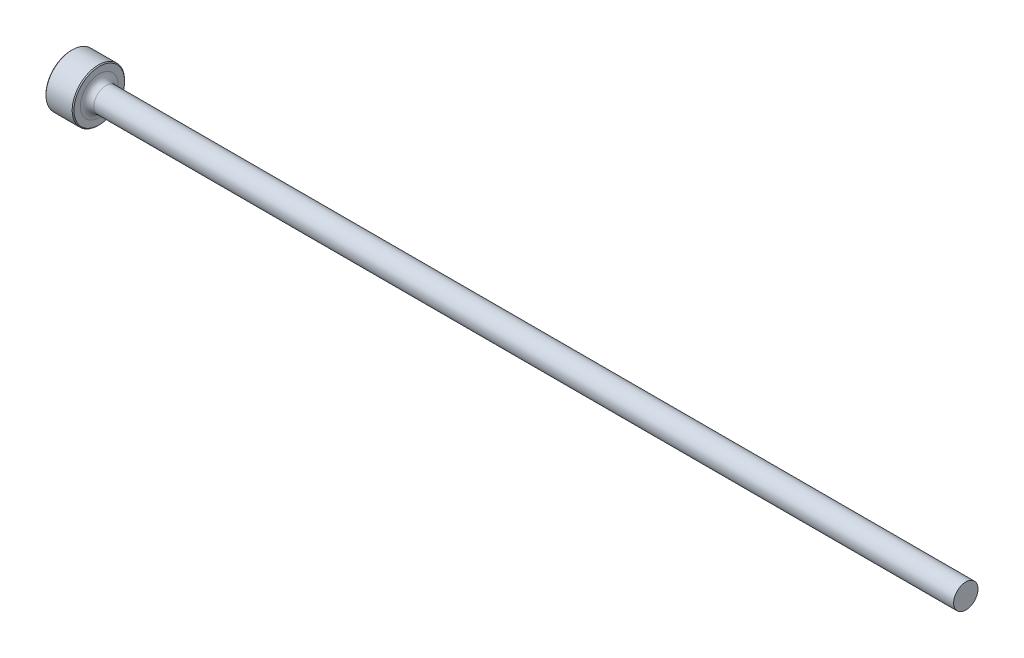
ISO-10303-21;
HEADER;
FILE_DESCRIPTION(('STEP AP214'),'2;1');
FILE_NAME('part.step','',(''),(''),'','','');
FILE_SCHEMA(('AUTOMOTIVE_DESIGN { 1 0 10303 214 1 1 1 1 }'));
ENDSEC;
DATA;
#1=APPLICATION_CONTEXT('core data for automotive mechanical design processes');
#2=APPLICATION_PROTOCOL_DEFINITION('international standard','automotive_design',2000,#1);
#3=PRODUCT_CONTEXT('',#1,'mechanical');
#4=PRODUCT('Part','Part','',(#3));
#5=PRODUCT_RELATED_PRODUCT_CATEGORY('part','',(#4));
#6=PRODUCT_DEFINITION_FORMATION('','',#4);
#7=PRODUCT_DEFINITION_CONTEXT('part definition',#1,'design');
#8=PRODUCT_DEFINITION('design','',#6,#7);
#9=PRODUCT_DEFINITION_SHAPE('','',#8);
#10=(LENGTH_UNIT() NAMED_UNIT(*) SI_UNIT(.MILLI.,.METRE.));
#11=(NAMED_UNIT(*) PLANE_ANGLE_UNIT() SI_UNIT($,.RADIAN.));
#12=(NAMED_UNIT(*) SI_UNIT($,.STERADIAN.) SOLID_ANGLE_UNIT());
#13=UNCERTAINTY_MEASURE_WITH_UNIT(LENGTH_MEASURE(1.E-05),#10,'distance_accuracy_value','');
#14=(GEOMETRIC_REPRESENTATION_CONTEXT(3) GLOBAL_UNCERTAINTY_ASSIGNED_CONTEXT((#13)) GLOBAL_UNIT_ASSIGNED_CONTEXT((#10,
#11,#12)) REPRESENTATION_CONTEXT('',''));
#15=CARTESIAN_POINT('',(0.,0.,0.));
#16=DIRECTION('',(0.,0.,1.));
#17=DIRECTION('',(1.,0.,0.));
#18=AXIS2_PLACEMENT_3D('',#15,#16,#17);
#19=CARTESIAN_POINT('',(101.6,1.38525249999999,0.));
#20=DIRECTION('',(1.,0.,0.));
#21=DIRECTION('',(0.,1.,0.));
#22=AXIS2_PLACEMENT_3D('',#19,#20,#21);
#23=PLANE('',#22);
#24=CARTESIAN_POINT('',(101.6,0.,0.));
#25=DIRECTION('',(1.,0.,0.));
#26=DIRECTION('',(0.,1.,0.));
#27=AXIS2_PLACEMENT_3D('',#24,#25,#26);
#28=CIRCLE('',#27,1.3852525);
#29=CARTESIAN_POINT('',(101.6,1.38525249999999,0.));
#30=VERTEX_POINT('',#29);
#31=EDGE_CURVE('E50',#30,#30,#28,.T.);
#32=ORIENTED_EDGE('',*,*,#31,.T.);
#33=EDGE_LOOP('',(#32));
#34=FACE_BOUND('',#33,.T.);
#35=ADVANCED_FACE('F30',(#34),#23,.T.);
#36=CARTESIAN_POINT('',(101.6,0.,0.));
#37=DIRECTION('',(1.,0.,0.));
#38=DIRECTION('',(0.,1.,0.));
#39=AXIS2_PLACEMENT_3D('',#36,#37,#38);
#40=CYLINDRICAL_SURFACE('',#39,1.3852525);
#41=CARTESIAN_POINT('',(3.937,0.,0.));
#42=DIRECTION('',(1.,0.,0.));
#43=DIRECTION('',(0.,1.,0.));
#44=AXIS2_PLACEMENT_3D('',#41,#42,#43);
#45=CIRCLE('',#44,1.38525249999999);
#46=CARTESIAN_POINT('',(3.937,1.38525249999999,0.));
#47=VERTEX_POINT('',#46);
#48=EDGE_CURVE('E53',#47,#47,#45,.T.);
#49=ORIENTED_EDGE('',*,*,#48,.T.);
#50=EDGE_LOOP('',(#49));
#51=FACE_BOUND('',#50,.T.);
#52=ORIENTED_EDGE('',*,*,#31,.F.);
#53=EDGE_LOOP('',(#52));
#54=FACE_BOUND('',#53,.T.);
#55=ADVANCED_FACE('F74',(#51,#54),#40,.T.);
#56=CARTESIAN_POINT('',(3.937,0.,0.));
#57=DIRECTION('',(1.,0.,0.));
#58=DIRECTION('',(0.,1.,0.));
#59=AXIS2_PLACEMENT_3D('',#56,#57,#58);
#60=TOROIDAL_SURFACE('',#59,2.14725249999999,0.762);
#61=CARTESIAN_POINT('',(3.175,0.,0.));
#62=DIRECTION('',(1.,0.,0.));
#63=DIRECTION('',(0.,1.,0.));
#64=AXIS2_PLACEMENT_3D('',#61,#62,#63);
#65=CIRCLE('',#64,2.14725249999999);
#66=CARTESIAN_POINT('',(3.175,2.14725249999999,0.));
#67=VERTEX_POINT('',#66);
#68=EDGE_CURVE('E56',#67,#67,#65,.T.);
#69=ORIENTED_EDGE('',*,*,#68,.T.);
#70=EDGE_LOOP('',(#69));
#71=FACE_BOUND('',#70,.T.);
#72=ORIENTED_EDGE('',*,*,#48,.F.);
#73=EDGE_LOOP('',(#72));
#74=FACE_BOUND('',#73,.T.);
#75=ADVANCED_FACE('F60',(#71,#74),#60,.F.);
#76=CARTESIAN_POINT('',(3.175,2.9765625,0.));
#77=DIRECTION('',(1.,0.,0.));
#78=DIRECTION('',(0.,1.,0.));
#79=AXIS2_PLACEMENT_3D('',#76,#77,#78);
#80=PLANE('',#79);
#81=CARTESIAN_POINT('',(3.175,0.,0.));
#82=DIRECTION('',(1.,0.,0.));
#83=DIRECTION('',(0.,1.,0.));
#84=AXIS2_PLACEMENT_3D('',#81,#82,#83);
#85=CIRCLE('',#84,2.87496249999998);
#86=CARTESIAN_POINT('',(3.175,2.87496249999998,0.));
#87=VERTEX_POINT('',#86);
#88=EDGE_CURVE('E10',#87,#87,#85,.T.);
#89=ORIENTED_EDGE('',*,*,#88,.T.);
#90=EDGE_LOOP('',(#89));
#91=FACE_BOUND('',#90,.T.);
#92=ORIENTED_EDGE('',*,*,#68,.F.);
#93=EDGE_LOOP('',(#92));
#94=FACE_BOUND('',#93,.T.);
#95=ADVANCED_FACE('F63',(#91,#94),#80,.T.);
#96=CARTESIAN_POINT('',(101.6,0.,0.));
#97=DIRECTION('',(1.,0.,0.));
#98=DIRECTION('',(0.,1.,0.));
#99=AXIS2_PLACEMENT_3D('',#96,#97,#98);
#100=CYLINDRICAL_SURFACE('',#99,2.9765625);
#101=CARTESIAN_POINT('',(0.101599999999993,0.,0.));
#102=DIRECTION('',(-1.,0.,0.));
#103=DIRECTION('',(0.,-1.,0.));
#104=AXIS2_PLACEMENT_3D('',#101,#102,#103);
#105=CIRCLE('',#104,2.9765625);
#106=CARTESIAN_POINT('',(0.101599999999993,-2.9765625,0.));
#107=VERTEX_POINT('',#106);
#108=EDGE_CURVE('E41',#107,#107,#105,.F.);
#109=ORIENTED_EDGE('',*,*,#108,.T.);
#110=EDGE_LOOP('',(#109));
#111=FACE_BOUND('',#110,.T.);
#112=CARTESIAN_POINT('',(3.07339999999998,0.,0.));
#113=DIRECTION('',(1.,0.,0.));
#114=DIRECTION('',(0.,1.,0.));
#115=AXIS2_PLACEMENT_3D('',#112,#113,#114);
#116=CIRCLE('',#115,2.9765625);
#117=CARTESIAN_POINT('',(3.07339999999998,2.9765625,0.));
#118=VERTEX_POINT('',#117);
#119=EDGE_CURVE('E45',#118,#118,#116,.F.);
#120=ORIENTED_EDGE('',*,*,#119,.T.);
#121=EDGE_LOOP('',(#120));
#122=FACE_BOUND('',#121,.T.);
#123=ADVANCED_FACE('F65',(#111,#122),#100,.T.);
#124=CARTESIAN_POINT('',(0.,0.,0.));
#125=DIRECTION('',(-1.,0.,0.));
#126=DIRECTION('',(0.,-1.,0.));
#127=AXIS2_PLACEMENT_3D('',#124,#125,#126);
#128=PLANE('',#127);
#129=CARTESIAN_POINT('',(0.,0.,0.));
#130=DIRECTION('',(-1.,0.,0.));
#131=DIRECTION('',(0.,-1.,0.));
#132=AXIS2_PLACEMENT_3D('',#129,#130,#131);
#133=CIRCLE('',#132,2.87496250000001);
#134=CARTESIAN_POINT('',(0.,-2.87496250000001,0.));
#135=VERTEX_POINT('',#134);
#136=EDGE_CURVE('E37',#135,#135,#133,.T.);
#137=ORIENTED_EDGE('',*,*,#136,.T.);
#138=EDGE_LOOP('',(#137));
#139=FACE_BOUND('',#138,.T.);
#140=ADVANCED_FACE('F71',(#139),#128,.T.);
#141=CARTESIAN_POINT('',(0.101599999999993,0.,0.));
#142=DIRECTION('',(1.,0.,0.));
#143=DIRECTION('',(0.,1.,0.));
#144=AXIS2_PLACEMENT_3D('',#141,#142,#143);
#145=CONICAL_SURFACE('',#144,2.9765625,0.78539816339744);
#146=ORIENTED_EDGE('',*,*,#136,.F.);
#147=EDGE_LOOP('',(#146));
#148=FACE_BOUND('',#147,.T.);
#149=ORIENTED_EDGE('',*,*,#108,.F.);
#150=EDGE_LOOP('',(#149));
#151=FACE_BOUND('',#150,.T.);
#152=ADVANCED_FACE('F84',(#148,#151),#145,.T.);
#153=CARTESIAN_POINT('',(3.175,0.,0.));
#154=DIRECTION('',(-1.,0.,0.));
#155=DIRECTION('',(0.,-1.,0.));
#156=AXIS2_PLACEMENT_3D('',#153,#154,#155);
#157=CONICAL_SURFACE('',#156,2.87496249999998,0.785398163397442);
#158=ORIENTED_EDGE('',*,*,#119,.F.);
#159=EDGE_LOOP('',(#158));
#160=FACE_BOUND('',#159,.T.);
#161=ORIENTED_EDGE('',*,*,#88,.F.);
#162=EDGE_LOOP('',(#161));
#163=FACE_BOUND('',#162,.T.);
#164=ADVANCED_FACE('F32',(#160,#163),#157,.T.);
#165=CLOSED_SHELL('',(#35,#55,#75,#95,#123,#140,#152,#164));
#166=MANIFOLD_SOLID_BREP('B2',#165);
#167=ADVANCED_BREP_SHAPE_REPRESENTATION('',(#18,#166),#14);
#168=SHAPE_DEFINITION_REPRESENTATION(#9,#167);
ENDSEC;
END-ISO-10303-21;
